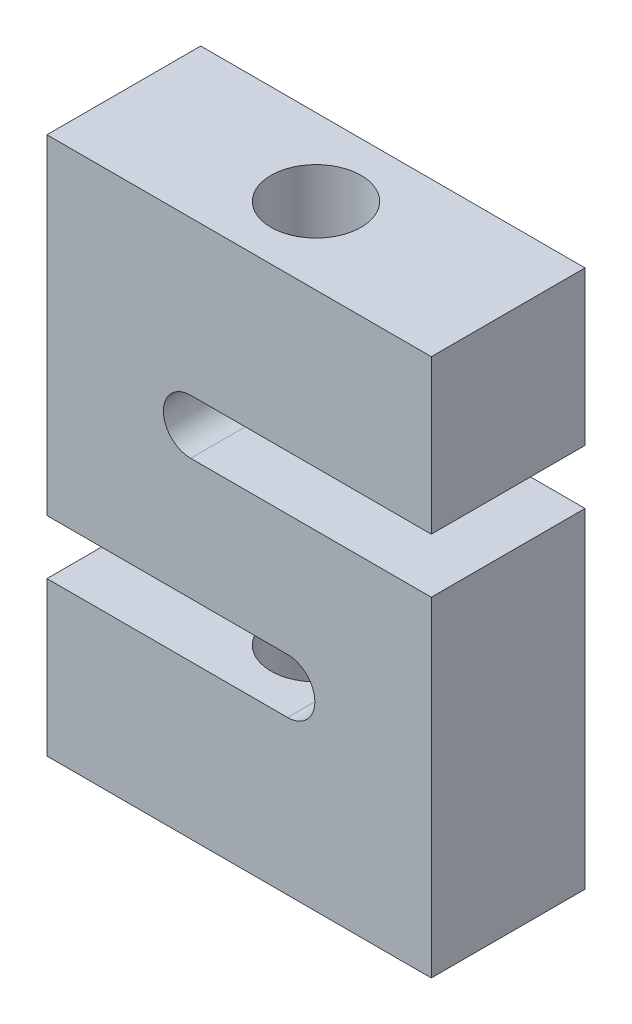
ISO-10303-21;
HEADER;
FILE_DESCRIPTION(('STEP AP214'),'2;1');
FILE_NAME('part.step','',(''),(''),'','','');
FILE_SCHEMA(('AUTOMOTIVE_DESIGN { 1 0 10303 214 1 1 1 1 }'));
ENDSEC;
DATA;
#1=APPLICATION_CONTEXT('core data for automotive mechanical design processes');
#2=APPLICATION_PROTOCOL_DEFINITION('international standard','automotive_design',2000,#1);
#3=PRODUCT_CONTEXT('',#1,'mechanical');
#4=PRODUCT('Part','Part','',(#3));
#5=PRODUCT_RELATED_PRODUCT_CATEGORY('part','',(#4));
#6=PRODUCT_DEFINITION_FORMATION('','',#4);
#7=PRODUCT_DEFINITION_CONTEXT('part definition',#1,'design');
#8=PRODUCT_DEFINITION('design','',#6,#7);
#9=PRODUCT_DEFINITION_SHAPE('','',#8);
#10=(LENGTH_UNIT() NAMED_UNIT(*) SI_UNIT(.MILLI.,.METRE.));
#11=(NAMED_UNIT(*) PLANE_ANGLE_UNIT() SI_UNIT($,.RADIAN.));
#12=(NAMED_UNIT(*) SI_UNIT($,.STERADIAN.) SOLID_ANGLE_UNIT());
#13=UNCERTAINTY_MEASURE_WITH_UNIT(LENGTH_MEASURE(1.E-05),#10,'distance_accuracy_value','');
#14=(GEOMETRIC_REPRESENTATION_CONTEXT(3) GLOBAL_UNCERTAINTY_ASSIGNED_CONTEXT((#13)) GLOBAL_UNIT_ASSIGNED_CONTEXT((#10,
#11,#12)) REPRESENTATION_CONTEXT('',''));
#15=CARTESIAN_POINT('',(0.,0.,0.));
#16=DIRECTION('',(0.,0.,1.));
#17=DIRECTION('',(1.,0.,0.));
#18=AXIS2_PLACEMENT_3D('',#15,#16,#17);
#19=CARTESIAN_POINT('',(63.5,20.066,25.4));
#20=DIRECTION('',(-1.,0.,0.));
#21=DIRECTION('',(0.,-1.,0.));
#22=AXIS2_PLACEMENT_3D('',#19,#20,#21);
#23=PLANE('',#22);
#24=DIRECTION('',(0.,1.,0.));
#25=VECTOR('',#24,1.);
#26=CARTESIAN_POINT('',(63.5,20.066,-25.4));
#27=LINE('',#26,#25);
#28=CARTESIAN_POINT('',(63.5,-88.9,-25.4));
#29=VERTEX_POINT('',#28);
#30=CARTESIAN_POINT('',(63.5,20.066,-25.4));
#31=VERTEX_POINT('',#30);
#32=EDGE_CURVE('E155',#29,#31,#27,.T.);
#33=ORIENTED_EDGE('',*,*,#32,.T.);
#34=DIRECTION('',(0.,0.,-1.));
#35=VECTOR('',#34,1.);
#36=CARTESIAN_POINT('',(63.5,20.066,25.4));
#37=LINE('',#36,#35);
#38=CARTESIAN_POINT('',(63.5,20.066,25.4));
#39=VERTEX_POINT('',#38);
#40=EDGE_CURVE('E11',#39,#31,#37,.T.);
#41=ORIENTED_EDGE('',*,*,#40,.F.);
#42=DIRECTION('',(0.,1.,0.));
#43=VECTOR('',#42,1.);
#44=CARTESIAN_POINT('',(63.5,20.066,25.4));
#45=LINE('',#44,#43);
#46=CARTESIAN_POINT('',(63.5,-88.9,25.4));
#47=VERTEX_POINT('',#46);
#48=EDGE_CURVE('E178',#47,#39,#45,.T.);
#49=ORIENTED_EDGE('',*,*,#48,.F.);
#50=DIRECTION('',(0.,0.,-1.));
#51=VECTOR('',#50,1.);
#52=CARTESIAN_POINT('',(63.5,-88.9,25.4));
#53=LINE('',#52,#51);
#54=EDGE_CURVE('E151',#47,#29,#53,.T.);
#55=ORIENTED_EDGE('',*,*,#54,.T.);
#56=EDGE_LOOP('',(#33,#41,#49,#55));
#57=FACE_BOUND('',#56,.T.);
#58=ADVANCED_FACE('F35',(#57),#23,.F.);
#59=CARTESIAN_POINT('',(63.5,20.066,25.4));
#60=DIRECTION('',(0.,-1.,0.));
#61=DIRECTION('',(1.,0.,0.));
#62=AXIS2_PLACEMENT_3D('',#59,#60,#61);
#63=PLANE('',#62);
#64=DIRECTION('',(-1.,0.,0.));
#65=VECTOR('',#64,1.);
#66=CARTESIAN_POINT('',(63.5,20.066,-25.4));
#67=LINE('',#66,#65);
#68=CARTESIAN_POINT('',(-16.002,20.066,-25.4));
#69=VERTEX_POINT('',#68);
#70=EDGE_CURVE('E158',#31,#69,#67,.T.);
#71=ORIENTED_EDGE('',*,*,#70,.T.);
#72=DIRECTION('',(0.,0.,-1.));
#73=VECTOR('',#72,1.);
#74=CARTESIAN_POINT('',(-16.002,20.066,25.4));
#75=LINE('',#74,#73);
#76=CARTESIAN_POINT('',(-16.002,20.066,25.4));
#77=VERTEX_POINT('',#76);
#78=EDGE_CURVE('E43',#77,#69,#75,.T.);
#79=ORIENTED_EDGE('',*,*,#78,.F.);
#80=DIRECTION('',(-1.,0.,0.));
#81=VECTOR('',#80,1.);
#82=CARTESIAN_POINT('',(63.5,20.066,25.4));
#83=LINE('',#82,#81);
#84=EDGE_CURVE('E106',#39,#77,#83,.T.);
#85=ORIENTED_EDGE('',*,*,#84,.F.);
#86=ORIENTED_EDGE('',*,*,#40,.T.);
#87=EDGE_LOOP('',(#71,#79,#85,#86));
#88=FACE_BOUND('',#87,.T.);
#89=ADVANCED_FACE('F258',(#88),#63,.F.);
#90=CARTESIAN_POINT('',(-16.002,29.083,25.4));
#91=DIRECTION('',(0.,0.,-1.));
#92=DIRECTION('',(-1.,0.,0.));
#93=AXIS2_PLACEMENT_3D('',#90,#91,#92);
#94=CYLINDRICAL_SURFACE('',#93,9.017);
#95=CARTESIAN_POINT('',(-16.002,29.083,-25.4));
#96=DIRECTION('',(0.,0.,-1.));
#97=DIRECTION('',(1.,0.,0.));
#98=AXIS2_PLACEMENT_3D('',#95,#96,#97);
#99=CIRCLE('',#98,9.017);
#100=CARTESIAN_POINT('',(-16.002,38.1,-25.4));
#101=VERTEX_POINT('',#100);
#102=EDGE_CURVE('E161',#69,#101,#99,.T.);
#103=ORIENTED_EDGE('',*,*,#102,.T.);
#104=DIRECTION('',(0.,0.,-1.));
#105=VECTOR('',#104,1.);
#106=CARTESIAN_POINT('',(-16.002,38.1,25.4));
#107=LINE('',#106,#105);
#108=CARTESIAN_POINT('',(-16.002,38.1,25.4));
#109=VERTEX_POINT('',#108);
#110=EDGE_CURVE('E197',#109,#101,#107,.T.);
#111=ORIENTED_EDGE('',*,*,#110,.F.);
#112=CARTESIAN_POINT('',(-16.002,29.083,25.4));
#113=DIRECTION('',(0.,0.,-1.));
#114=DIRECTION('',(1.,0.,0.));
#115=AXIS2_PLACEMENT_3D('',#112,#113,#114);
#116=CIRCLE('',#115,9.017);
#117=EDGE_CURVE('E205',#77,#109,#116,.T.);
#118=ORIENTED_EDGE('',*,*,#117,.F.);
#119=ORIENTED_EDGE('',*,*,#78,.T.);
#120=EDGE_LOOP('',(#103,#111,#118,#119));
#121=FACE_BOUND('',#120,.T.);
#122=ADVANCED_FACE('F203',(#121),#94,.F.);
#123=CARTESIAN_POINT('',(63.5,38.1,25.4));
#124=DIRECTION('',(0.,1.,0.));
#125=DIRECTION('',(-1.,0.,0.));
#126=AXIS2_PLACEMENT_3D('',#123,#124,#125);
#127=PLANE('',#126);
#128=CARTESIAN_POINT('',(0.,38.1,0.));
#129=DIRECTION('',(0.,1.,0.));
#130=DIRECTION('',(-1.,0.,0.));
#131=AXIS2_PLACEMENT_3D('',#128,#129,#130);
#132=CIRCLE('',#131,14.88313);
#133=CARTESIAN_POINT('',(-14.88313,38.1,0.));
#134=VERTEX_POINT('',#133);
#135=EDGE_CURVE('E159',#134,#134,#132,.T.);
#136=ORIENTED_EDGE('',*,*,#135,.T.);
#137=EDGE_LOOP('',(#136));
#138=FACE_BOUND('',#137,.T.);
#139=DIRECTION('',(1.,0.,0.));
#140=VECTOR('',#139,1.);
#141=CARTESIAN_POINT('',(63.5,38.1,-25.4));
#142=LINE('',#141,#140);
#143=CARTESIAN_POINT('',(63.5,38.1,-25.4));
#144=VERTEX_POINT('',#143);
#145=EDGE_CURVE('E163',#101,#144,#142,.T.);
#146=ORIENTED_EDGE('',*,*,#145,.T.);
#147=DIRECTION('',(0.,0.,-1.));
#148=VECTOR('',#147,1.);
#149=CARTESIAN_POINT('',(63.5,38.1,25.4));
#150=LINE('',#149,#148);
#151=CARTESIAN_POINT('',(63.5,38.1,25.4));
#152=VERTEX_POINT('',#151);
#153=EDGE_CURVE('E194',#152,#144,#150,.T.);
#154=ORIENTED_EDGE('',*,*,#153,.F.);
#155=DIRECTION('',(1.,0.,0.));
#156=VECTOR('',#155,1.);
#157=CARTESIAN_POINT('',(63.5,38.1,25.4));
#158=LINE('',#157,#156);
#159=EDGE_CURVE('E223',#109,#152,#158,.T.);
#160=ORIENTED_EDGE('',*,*,#159,.F.);
#161=ORIENTED_EDGE('',*,*,#110,.T.);
#162=EDGE_LOOP('',(#146,#154,#160,#161));
#163=FACE_BOUND('',#162,.T.);
#164=ADVANCED_FACE('F214',(#138,#163),#127,.F.);
#165=CARTESIAN_POINT('',(63.5,88.9,25.4));
#166=DIRECTION('',(-1.,0.,0.));
#167=DIRECTION('',(0.,0.,1.));
#168=AXIS2_PLACEMENT_3D('',#165,#166,#167);
#169=PLANE('',#168);
#170=DIRECTION('',(0.,1.,0.));
#171=VECTOR('',#170,1.);
#172=CARTESIAN_POINT('',(63.5,88.9,-25.4));
#173=LINE('',#172,#171);
#174=CARTESIAN_POINT('',(63.5,88.9,-25.4));
#175=VERTEX_POINT('',#174);
#176=EDGE_CURVE('E165',#144,#175,#173,.T.);
#177=ORIENTED_EDGE('',*,*,#176,.T.);
#178=DIRECTION('',(0.,0.,-1.));
#179=VECTOR('',#178,1.);
#180=CARTESIAN_POINT('',(63.5,88.9,25.4));
#181=LINE('',#180,#179);
#182=CARTESIAN_POINT('',(63.5,88.9,25.4));
#183=VERTEX_POINT('',#182);
#184=EDGE_CURVE('E191',#183,#175,#181,.T.);
#185=ORIENTED_EDGE('',*,*,#184,.F.);
#186=DIRECTION('',(0.,1.,0.));
#187=VECTOR('',#186,1.);
#188=CARTESIAN_POINT('',(63.5,88.9,25.4));
#189=LINE('',#188,#187);
#190=EDGE_CURVE('E220',#152,#183,#189,.T.);
#191=ORIENTED_EDGE('',*,*,#190,.F.);
#192=ORIENTED_EDGE('',*,*,#153,.T.);
#193=EDGE_LOOP('',(#177,#185,#191,#192));
#194=FACE_BOUND('',#193,.T.);
#195=ADVANCED_FACE('F218',(#194),#169,.F.);
#196=CARTESIAN_POINT('',(-63.5,88.9,25.4));
#197=DIRECTION('',(0.,-1.,0.));
#198=DIRECTION('',(0.,0.,-1.));
#199=AXIS2_PLACEMENT_3D('',#196,#197,#198);
#200=PLANE('',#199);
#201=CARTESIAN_POINT('',(0.,88.9,0.));
#202=DIRECTION('',(0.,1.,0.));
#203=DIRECTION('',(0.,0.,1.));
#204=AXIS2_PLACEMENT_3D('',#201,#202,#203);
#205=CIRCLE('',#204,14.88313);
#206=CARTESIAN_POINT('',(0.,88.9,14.88313));
#207=VERTEX_POINT('',#206);
#208=EDGE_CURVE('E292',#207,#207,#205,.T.);
#209=ORIENTED_EDGE('',*,*,#208,.F.);
#210=EDGE_LOOP('',(#209));
#211=FACE_BOUND('',#210,.T.);
#212=DIRECTION('',(-1.,0.,0.));
#213=VECTOR('',#212,1.);
#214=CARTESIAN_POINT('',(-63.5,88.9,-25.4));
#215=LINE('',#214,#213);
#216=CARTESIAN_POINT('',(-63.5,88.9,-25.4));
#217=VERTEX_POINT('',#216);
#218=EDGE_CURVE('E167',#175,#217,#215,.T.);
#219=ORIENTED_EDGE('',*,*,#218,.T.);
#220=DIRECTION('',(0.,0.,-1.));
#221=VECTOR('',#220,1.);
#222=CARTESIAN_POINT('',(-63.5,88.9,25.4));
#223=LINE('',#222,#221);
#224=CARTESIAN_POINT('',(-63.5,88.9,25.4));
#225=VERTEX_POINT('',#224);
#226=EDGE_CURVE('E188',#225,#217,#223,.T.);
#227=ORIENTED_EDGE('',*,*,#226,.F.);
#228=DIRECTION('',(-1.,0.,0.));
#229=VECTOR('',#228,1.);
#230=CARTESIAN_POINT('',(-63.5,88.9,25.4));
#231=LINE('',#230,#229);
#232=EDGE_CURVE('E222',#183,#225,#231,.T.);
#233=ORIENTED_EDGE('',*,*,#232,.F.);
#234=ORIENTED_EDGE('',*,*,#184,.T.);
#235=EDGE_LOOP('',(#219,#227,#233,#234));
#236=FACE_BOUND('',#235,.T.);
#237=ADVANCED_FACE('F272',(#211,#236),#200,.F.);
#238=CARTESIAN_POINT('',(-63.5,88.9,25.4));
#239=DIRECTION('',(1.,0.,0.));
#240=DIRECTION('',(0.,1.,0.));
#241=AXIS2_PLACEMENT_3D('',#238,#239,#240);
#242=PLANE('',#241);
#243=DIRECTION('',(0.,-1.,0.));
#244=VECTOR('',#243,1.);
#245=CARTESIAN_POINT('',(-63.5,88.9,-25.4));
#246=LINE('',#245,#244);
#247=CARTESIAN_POINT('',(-63.5,-20.066,-25.4));
#248=VERTEX_POINT('',#247);
#249=EDGE_CURVE('E169',#217,#248,#246,.T.);
#250=ORIENTED_EDGE('',*,*,#249,.T.);
#251=DIRECTION('',(0.,0.,-1.));
#252=VECTOR('',#251,1.);
#253=CARTESIAN_POINT('',(-63.5,-20.066,25.4));
#254=LINE('',#253,#252);
#255=CARTESIAN_POINT('',(-63.5,-20.066,25.4));
#256=VERTEX_POINT('',#255);
#257=EDGE_CURVE('E185',#256,#248,#254,.T.);
#258=ORIENTED_EDGE('',*,*,#257,.F.);
#259=DIRECTION('',(0.,-1.,0.));
#260=VECTOR('',#259,1.);
#261=CARTESIAN_POINT('',(-63.5,88.9,25.4));
#262=LINE('',#261,#260);
#263=EDGE_CURVE('E225',#225,#256,#262,.T.);
#264=ORIENTED_EDGE('',*,*,#263,.F.);
#265=ORIENTED_EDGE('',*,*,#226,.T.);
#266=EDGE_LOOP('',(#250,#258,#264,#265));
#267=FACE_BOUND('',#266,.T.);
#268=ADVANCED_FACE('F275',(#267),#242,.F.);
#269=CARTESIAN_POINT('',(-63.5,-20.066,25.4));
#270=DIRECTION('',(0.,1.,0.));
#271=DIRECTION('',(0.,0.,1.));
#272=AXIS2_PLACEMENT_3D('',#269,#270,#271);
#273=PLANE('',#272);
#274=DIRECTION('',(1.,0.,0.));
#275=VECTOR('',#274,1.);
#276=CARTESIAN_POINT('',(-63.5,-20.066,-25.4));
#277=LINE('',#276,#275);
#278=CARTESIAN_POINT('',(16.002,-20.066,-25.4));
#279=VERTEX_POINT('',#278);
#280=EDGE_CURVE('E171',#248,#279,#277,.T.);
#281=ORIENTED_EDGE('',*,*,#280,.T.);
#282=DIRECTION('',(0.,0.,-1.));
#283=VECTOR('',#282,1.);
#284=CARTESIAN_POINT('',(16.002,-20.066,25.4));
#285=LINE('',#284,#283);
#286=CARTESIAN_POINT('',(16.002,-20.066,25.4));
#287=VERTEX_POINT('',#286);
#288=EDGE_CURVE('E182',#287,#279,#285,.T.);
#289=ORIENTED_EDGE('',*,*,#288,.F.);
#290=DIRECTION('',(1.,0.,0.));
#291=VECTOR('',#290,1.);
#292=CARTESIAN_POINT('',(-63.5,-20.066,25.4));
#293=LINE('',#292,#291);
#294=EDGE_CURVE('E231',#256,#287,#293,.T.);
#295=ORIENTED_EDGE('',*,*,#294,.F.);
#296=ORIENTED_EDGE('',*,*,#257,.T.);
#297=EDGE_LOOP('',(#281,#289,#295,#296));
#298=FACE_BOUND('',#297,.T.);
#299=ADVANCED_FACE('F237',(#298),#273,.F.);
#300=CARTESIAN_POINT('',(16.002,-29.083,25.4));
#301=DIRECTION('',(0.,0.,-1.));
#302=DIRECTION('',(-1.,0.,0.));
#303=AXIS2_PLACEMENT_3D('',#300,#301,#302);
#304=CYLINDRICAL_SURFACE('',#303,9.01699999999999);
#305=CARTESIAN_POINT('',(16.002,-29.083,-25.4));
#306=DIRECTION('',(0.,0.,-1.));
#307=DIRECTION('',(1.,0.,0.));
#308=AXIS2_PLACEMENT_3D('',#305,#306,#307);
#309=CIRCLE('',#308,9.01699999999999);
#310=CARTESIAN_POINT('',(16.002,-38.1,-25.4));
#311=VERTEX_POINT('',#310);
#312=EDGE_CURVE('E173',#279,#311,#309,.T.);
#313=ORIENTED_EDGE('',*,*,#312,.T.);
#314=DIRECTION('',(0.,0.,-1.));
#315=VECTOR('',#314,1.);
#316=CARTESIAN_POINT('',(16.002,-38.1,25.4));
#317=LINE('',#316,#315);
#318=CARTESIAN_POINT('',(16.002,-38.1,25.4));
#319=VERTEX_POINT('',#318);
#320=EDGE_CURVE('E146',#319,#311,#317,.T.);
#321=ORIENTED_EDGE('',*,*,#320,.F.);
#322=CARTESIAN_POINT('',(16.002,-29.083,25.4));
#323=DIRECTION('',(0.,0.,-1.));
#324=DIRECTION('',(1.,0.,0.));
#325=AXIS2_PLACEMENT_3D('',#322,#323,#324);
#326=CIRCLE('',#325,9.01699999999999);
#327=EDGE_CURVE('E137',#287,#319,#326,.T.);
#328=ORIENTED_EDGE('',*,*,#327,.F.);
#329=ORIENTED_EDGE('',*,*,#288,.T.);
#330=EDGE_LOOP('',(#313,#321,#328,#329));
#331=FACE_BOUND('',#330,.T.);
#332=ADVANCED_FACE('F241',(#331),#304,.F.);
#333=CARTESIAN_POINT('',(16.002,-38.1,25.4));
#334=DIRECTION('',(0.,-1.,0.));
#335=DIRECTION('',(1.,0.,0.));
#336=AXIS2_PLACEMENT_3D('',#333,#334,#335);
#337=PLANE('',#336);
#338=CARTESIAN_POINT('',(0.,-38.1,0.));
#339=DIRECTION('',(0.,-1.,0.));
#340=DIRECTION('',(1.,0.,0.));
#341=AXIS2_PLACEMENT_3D('',#338,#339,#340);
#342=CIRCLE('',#341,14.88313);
#343=CARTESIAN_POINT('',(14.88313,-38.1,0.));
#344=VERTEX_POINT('',#343);
#345=EDGE_CURVE('E290',#344,#344,#342,.T.);
#346=ORIENTED_EDGE('',*,*,#345,.T.);
#347=EDGE_LOOP('',(#346));
#348=FACE_BOUND('',#347,.T.);
#349=DIRECTION('',(-1.,0.,0.));
#350=VECTOR('',#349,1.);
#351=CARTESIAN_POINT('',(16.002,-38.1,-25.4));
#352=LINE('',#351,#350);
#353=CARTESIAN_POINT('',(-63.5,-38.1,-25.4));
#354=VERTEX_POINT('',#353);
#355=EDGE_CURVE('E145',#311,#354,#352,.T.);
#356=ORIENTED_EDGE('',*,*,#355,.T.);
#357=DIRECTION('',(0.,0.,-1.));
#358=VECTOR('',#357,1.);
#359=CARTESIAN_POINT('',(-63.5,-38.1,25.4));
#360=LINE('',#359,#358);
#361=CARTESIAN_POINT('',(-63.5,-38.1,25.4));
#362=VERTEX_POINT('',#361);
#363=EDGE_CURVE('E142',#362,#354,#360,.T.);
#364=ORIENTED_EDGE('',*,*,#363,.F.);
#365=DIRECTION('',(-1.,0.,0.));
#366=VECTOR('',#365,1.);
#367=CARTESIAN_POINT('',(16.002,-38.1,25.4));
#368=LINE('',#367,#366);
#369=EDGE_CURVE('E131',#319,#362,#368,.T.);
#370=ORIENTED_EDGE('',*,*,#369,.F.);
#371=ORIENTED_EDGE('',*,*,#320,.T.);
#372=EDGE_LOOP('',(#356,#364,#370,#371));
#373=FACE_BOUND('',#372,.T.);
#374=ADVANCED_FACE('F143',(#348,#373),#337,.F.);
#375=CARTESIAN_POINT('',(-63.5,-38.1,25.4));
#376=DIRECTION('',(1.,0.,0.));
#377=DIRECTION('',(0.,1.,0.));
#378=AXIS2_PLACEMENT_3D('',#375,#376,#377);
#379=PLANE('',#378);
#380=DIRECTION('',(0.,-1.,0.));
#381=VECTOR('',#380,1.);
#382=CARTESIAN_POINT('',(-63.5,-38.1,-25.4));
#383=LINE('',#382,#381);
#384=CARTESIAN_POINT('',(-63.5,-88.9,-25.4));
#385=VERTEX_POINT('',#384);
#386=EDGE_CURVE('E92',#354,#385,#383,.T.);
#387=ORIENTED_EDGE('',*,*,#386,.T.);
#388=DIRECTION('',(0.,0.,-1.));
#389=VECTOR('',#388,1.);
#390=CARTESIAN_POINT('',(-63.5,-88.9,25.4));
#391=LINE('',#390,#389);
#392=CARTESIAN_POINT('',(-63.5,-88.9,25.4));
#393=VERTEX_POINT('',#392);
#394=EDGE_CURVE('E147',#393,#385,#391,.T.);
#395=ORIENTED_EDGE('',*,*,#394,.F.);
#396=DIRECTION('',(0.,-1.,0.));
#397=VECTOR('',#396,1.);
#398=CARTESIAN_POINT('',(-63.5,-38.1,25.4));
#399=LINE('',#398,#397);
#400=EDGE_CURVE('E135',#362,#393,#399,.T.);
#401=ORIENTED_EDGE('',*,*,#400,.F.);
#402=ORIENTED_EDGE('',*,*,#363,.T.);
#403=EDGE_LOOP('',(#387,#395,#401,#402));
#404=FACE_BOUND('',#403,.T.);
#405=ADVANCED_FACE('F149',(#404),#379,.F.);
#406=CARTESIAN_POINT('',(-63.5,-88.9,25.4));
#407=DIRECTION('',(0.,1.,0.));
#408=DIRECTION('',(-1.,0.,0.));
#409=AXIS2_PLACEMENT_3D('',#406,#407,#408);
#410=PLANE('',#409);
#411=CARTESIAN_POINT('',(0.,-88.9,0.));
#412=DIRECTION('',(0.,-1.,0.));
#413=DIRECTION('',(0.,0.,-1.));
#414=AXIS2_PLACEMENT_3D('',#411,#412,#413);
#415=CIRCLE('',#414,14.88313);
#416=CARTESIAN_POINT('',(0.,-88.9,-14.88313));
#417=VERTEX_POINT('',#416);
#418=EDGE_CURVE('E293',#417,#417,#415,.T.);
#419=ORIENTED_EDGE('',*,*,#418,.F.);
#420=EDGE_LOOP('',(#419));
#421=FACE_BOUND('',#420,.T.);
#422=DIRECTION('',(1.,0.,0.));
#423=VECTOR('',#422,1.);
#424=CARTESIAN_POINT('',(-63.5,-88.9,-25.4));
#425=LINE('',#424,#423);
#426=EDGE_CURVE('E98',#385,#29,#425,.T.);
#427=ORIENTED_EDGE('',*,*,#426,.T.);
#428=ORIENTED_EDGE('',*,*,#54,.F.);
#429=DIRECTION('',(1.,0.,0.));
#430=VECTOR('',#429,1.);
#431=CARTESIAN_POINT('',(-63.5,-88.9,25.4));
#432=LINE('',#431,#430);
#433=EDGE_CURVE('E51',#393,#47,#432,.T.);
#434=ORIENTED_EDGE('',*,*,#433,.F.);
#435=ORIENTED_EDGE('',*,*,#394,.T.);
#436=EDGE_LOOP('',(#427,#428,#434,#435));
#437=FACE_BOUND('',#436,.T.);
#438=ADVANCED_FACE('F245',(#421,#437),#410,.F.);
#439=CARTESIAN_POINT('',(16.002,-29.083,25.4));
#440=DIRECTION('',(0.,0.,1.));
#441=DIRECTION('',(1.,0.,0.));
#442=AXIS2_PLACEMENT_3D('',#439,#440,#441);
#443=PLANE('',#442);
#444=ORIENTED_EDGE('',*,*,#48,.T.);
#445=ORIENTED_EDGE('',*,*,#84,.T.);
#446=ORIENTED_EDGE('',*,*,#117,.T.);
#447=ORIENTED_EDGE('',*,*,#159,.T.);
#448=ORIENTED_EDGE('',*,*,#190,.T.);
#449=ORIENTED_EDGE('',*,*,#232,.T.);
#450=ORIENTED_EDGE('',*,*,#263,.T.);
#451=ORIENTED_EDGE('',*,*,#294,.T.);
#452=ORIENTED_EDGE('',*,*,#327,.T.);
#453=ORIENTED_EDGE('',*,*,#369,.T.);
#454=ORIENTED_EDGE('',*,*,#400,.T.);
#455=ORIENTED_EDGE('',*,*,#433,.T.);
#456=EDGE_LOOP('',(#444,#445,#446,#447,#448,#449,#450,#451,#452,#453,#454,#455));
#457=FACE_BOUND('',#456,.T.);
#458=ADVANCED_FACE('F133',(#457),#443,.T.);
#459=CARTESIAN_POINT('',(16.002,-29.083,-25.4));
#460=DIRECTION('',(0.,0.,1.));
#461=DIRECTION('',(1.,0.,0.));
#462=AXIS2_PLACEMENT_3D('',#459,#460,#461);
#463=PLANE('',#462);
#464=ORIENTED_EDGE('',*,*,#32,.F.);
#465=ORIENTED_EDGE('',*,*,#426,.F.);
#466=ORIENTED_EDGE('',*,*,#386,.F.);
#467=ORIENTED_EDGE('',*,*,#355,.F.);
#468=ORIENTED_EDGE('',*,*,#312,.F.);
#469=ORIENTED_EDGE('',*,*,#280,.F.);
#470=ORIENTED_EDGE('',*,*,#249,.F.);
#471=ORIENTED_EDGE('',*,*,#218,.F.);
#472=ORIENTED_EDGE('',*,*,#176,.F.);
#473=ORIENTED_EDGE('',*,*,#145,.F.);
#474=ORIENTED_EDGE('',*,*,#102,.F.);
#475=ORIENTED_EDGE('',*,*,#70,.F.);
#476=EDGE_LOOP('',(#464,#465,#466,#467,#468,#469,#470,#471,#472,#473,#474,#475));
#477=FACE_BOUND('',#476,.T.);
#478=ADVANCED_FACE('F209',(#477),#463,.F.);
#479=CARTESIAN_POINT('',(0.,88.9,0.));
#480=DIRECTION('',(0.,1.,0.));
#481=DIRECTION('',(0.,0.,1.));
#482=AXIS2_PLACEMENT_3D('',#479,#480,#481);
#483=CYLINDRICAL_SURFACE('',#482,14.88313);
#484=ORIENTED_EDGE('',*,*,#135,.F.);
#485=EDGE_LOOP('',(#484));
#486=FACE_BOUND('',#485,.T.);
#487=ORIENTED_EDGE('',*,*,#208,.T.);
#488=EDGE_LOOP('',(#487));
#489=FACE_BOUND('',#488,.T.);
#490=ADVANCED_FACE('F305',(#486,#489),#483,.F.);
#491=CARTESIAN_POINT('',(0.,-88.9,0.));
#492=DIRECTION('',(0.,-1.,0.));
#493=DIRECTION('',(0.,0.,-1.));
#494=AXIS2_PLACEMENT_3D('',#491,#492,#493);
#495=CYLINDRICAL_SURFACE('',#494,14.88313);
#496=ORIENTED_EDGE('',*,*,#345,.F.);
#497=EDGE_LOOP('',(#496));
#498=FACE_BOUND('',#497,.T.);
#499=ORIENTED_EDGE('',*,*,#418,.T.);
#500=EDGE_LOOP('',(#499));
#501=FACE_BOUND('',#500,.T.);
#502=ADVANCED_FACE('F308',(#498,#501),#495,.F.);
#503=CLOSED_SHELL('',(#58,#89,#122,#164,#195,#237,#268,#299,#332,#374,#405,#438,#458,#478,#490,#502));
#504=MANIFOLD_SOLID_BREP('B2',#503);
#505=ADVANCED_BREP_SHAPE_REPRESENTATION('',(#18,#504),#14);
#506=SHAPE_DEFINITION_REPRESENTATION(#9,#505);
ENDSEC;
END-ISO-10303-21;
